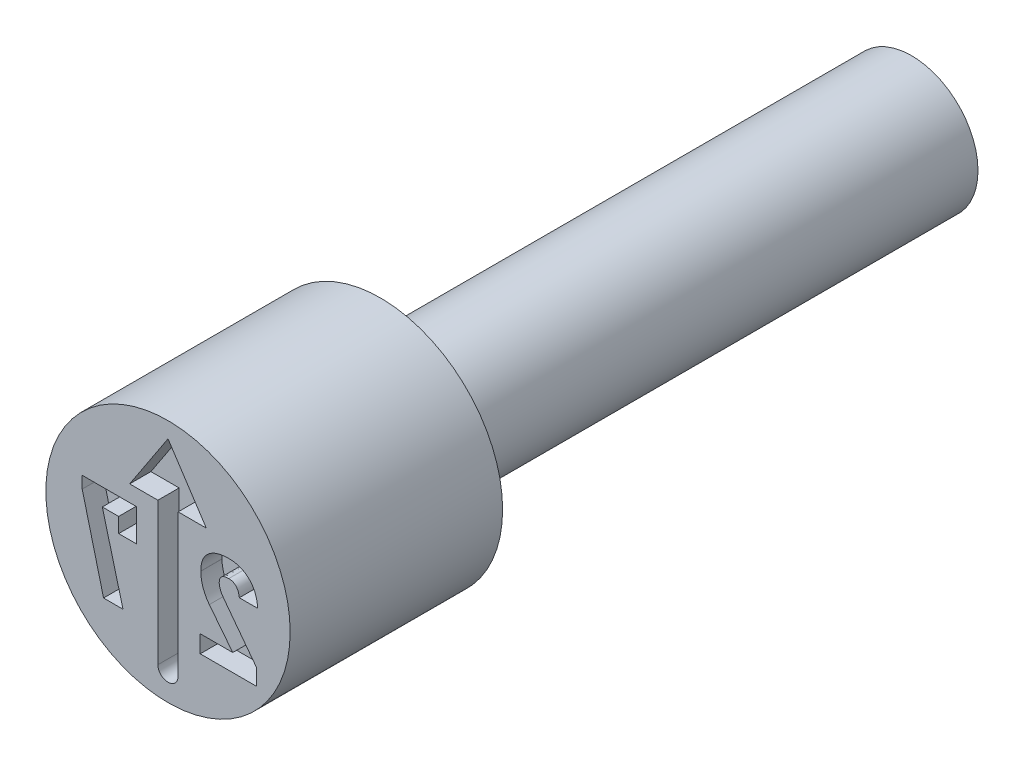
from build123d import *

# Parameters (mm, degrees)
CUT_EXTRUDE4_DEPTH = 0.4
CUT_EXTRUDE5_DEPTH = 0.4


with BuildPart() as part:
    # Sketch2 → Revolve1 (revolve)
    with BuildSketch(Plane(origin=(0, 0, 0), x_dir=(0, 0, -1), z_dir=(1, 0, 0)), mode=Mode.PRIVATE) as revolve1_sk:
        Polygon((0, 2.3), (0, 0), (14, 0), (14, 1.25), (4, 1.25), (4, 2.3), align=None)
    revolve(revolve1_sk.sketch.rotate(Axis((0, 0, -0.403888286), (0, 0, -1)), 90), axis=Axis((0, 0, -0.403888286), (0, 0, -1)))

    # Sketch3 → Cut-Extrude4 (cut)
    with BuildSketch(Plane.XY):
        with BuildLine():
            Line((0.190473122, 0.906351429), (0.190473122, -1.776161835))
            ThreePointArc((0.190473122, -1.776161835), (0, -1.966634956), (-0.190473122, -1.776161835))
            Line((-0.190473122, -1.776161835), (-0.190473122, 0.906351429))
            Line((-0.190473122, 0.906351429), (-0.721917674, 0.906351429))
            Line((-0.721917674, 0.906351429), (0, 2.002115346))
            Line((0, 2.002115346), (0.721917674, 0.906351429))
            Line((0.721917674, 0.906351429), (0.190473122, 0.906351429))
        make_face()
    extrude(amount=-CUT_EXTRUDE4_DEPTH, mode=Mode.SUBTRACT)

    # Sketch4 → Cut-Extrude5 (cut)
    with BuildSketch(Plane.XY):
        with BuildLine():
            Line((1.666680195, -1.2), (1.666680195, -0.893912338))
            Line((1.666680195, -0.893912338), (1.051582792, -0.079017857))
            add(Edge.make_bspline(
                [(1.051582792, -0.079017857), (1.038699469, -0.060864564), (1.013596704, -0.025493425), (0.990876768, 0.023081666), (0.976723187, 0.061165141), (0.969977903, 0.088783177), (0.965166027, 0.115133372), (0.964573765, 0.132447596), (0.964285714, 0.140868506)],
                knots=[0, 0, 0, 0, 1.664252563, 3.24274559, 3.998498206, 4.704056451, 5.369707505, 6, 6, 6, 6], degree=3))
            Line((0.964285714, 0.140868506), (0.964285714, 0.143425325))
            add(Edge.make_bspline(
                [(0.964285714, 0.143425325), (0.964784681, 0.154934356), (0.96574062, 0.176983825), (0.974747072, 0.20805196), (0.989508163, 0.23510756), (1.010649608, 0.257455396), (1.03696909, 0.27513119), (1.068461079, 0.287588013), (1.104713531, 0.294731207), (1.130445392, 0.29563044), (1.143993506, 0.296103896)],
                knots=[0, 0, 0, 0, 1.029992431, 1.973301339, 2.872554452, 3.768620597, 4.704316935, 5.693697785, 6.785705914, 8, 8, 8, 8], degree=3))
            add(Edge.make_bspline(
                [(1.143993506, 0.296103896), (1.157226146, 0.295587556), (1.182937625, 0.294584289), (1.219336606, 0.283465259), (1.252135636, 0.266024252), (1.280411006, 0.241138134), (1.303825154, 0.209892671), (1.322828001, 0.17309857), (1.335734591, 0.130091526), (1.34030008, 0.099305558), (1.342694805, 0.083157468)],
                knots=[0, 0, 0, 0, 0.980828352, 1.905783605, 2.800718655, 3.724477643, 4.680224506, 5.688112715, 6.78735127, 8, 8, 8, 8], degree=3))
            Line((1.342694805, 0.083157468), (1.342694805, 0.082061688))
            Line((1.342694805, 0.082061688), (1.688961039, 0.082061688))
            Line((1.688961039, 0.082061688), (1.688961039, 0.083157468))
            add(Edge.make_bspline(
                [(1.688961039, 0.083157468), (1.687252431, 0.104022), (1.683917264, 0.144749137), (1.672983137, 0.203662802), (1.658851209, 0.259155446), (1.640873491, 0.311216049), (1.61777206, 0.35924181), (1.5918169, 0.404236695), (1.560599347, 0.444809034), (1.52642736, 0.482316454), (1.488365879, 0.515352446), (1.447781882, 0.544494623), (1.404061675, 0.568745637), (1.357869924, 0.588863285), (1.308694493, 0.604132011), (1.257177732, 0.61556945), (1.202728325, 0.622165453), (1.165561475, 0.622966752), (1.146550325, 0.623376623)],
                knots=[0, 0, 0, 0, 1.173229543, 2.290119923, 3.354877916, 4.382703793, 5.372196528, 6.339367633, 7.289741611, 8.236749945, 9.180232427, 10.11040526, 11.033485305, 11.978374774, 12.930610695, 13.916256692, 14.93414813, 16, 16, 16, 16], degree=3))
            add(Edge.make_bspline(
                [(1.146550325, 0.623376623), (1.126079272, 0.62308583), (1.086265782, 0.622520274), (1.028304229, 0.61641528), (0.973768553, 0.607201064), (0.922746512, 0.593721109), (0.875442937, 0.576137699), (0.831716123, 0.554936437), (0.791474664, 0.529936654), (0.755026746, 0.501084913), (0.722232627, 0.468905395), (0.694005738, 0.433071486), (0.669570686, 0.394307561), (0.650469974, 0.351861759), (0.634744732, 0.306732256), (0.624562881, 0.25811011), (0.61770161, 0.20656779), (0.616945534, 0.171087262), (0.616558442, 0.152922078)],
                knots=[0, 0, 0, 0, 1.219700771, 2.37215663, 3.469774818, 4.513610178, 5.512457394, 6.473141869, 7.405450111, 8.330272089, 9.238546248, 10.1372905, 11.043445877, 11.962355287, 12.905558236, 13.886315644, 14.917844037, 16, 16, 16, 16], degree=3))
            Line((0.616558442, 0.152922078), (0.616558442, 0.151461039))
            add(Edge.make_bspline(
                [(0.616558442, 0.151461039), (0.617024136, 0.130980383), (0.617956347, 0.089982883), (0.626371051, 0.028624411), (0.639931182, -0.0324208), (0.658554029, -0.092857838), (0.68168837, -0.151639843), (0.70945403, -0.207961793), (0.740791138, -0.261848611), (0.765622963, -0.29510689), (0.778003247, -0.311688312)],
                knots=[0, 0, 0, 0, 0.984368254, 1.970475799, 2.971844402, 3.988480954, 5.008197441, 6.005725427, 7.005724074, 8, 8, 8, 8], degree=3))
            Line((0.778003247, -0.311688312), (1.219237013, -0.872727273))
            Line((1.219237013, -0.872727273), (0.606696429, -0.872727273))
            Line((0.606696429, -0.872727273), (0.606696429, -1.2))
            Line((0.606696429, -1.2), (1.666680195, -1.2))
        make_face()
        Polygon((-1.615149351, 0.6), (-1.615149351, 0.374269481), (-1.213363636, -1.2), (-0.847373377, -1.2), (-1.23674026, 0.272727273), (-0.928826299, 0.272727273), (-0.928826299, -0.007792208), (-0.590961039, -0.007792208), (-0.590961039, 0.6), align=None)
    extrude(amount=-CUT_EXTRUDE5_DEPTH, mode=Mode.SUBTRACT)


solid = part.part
